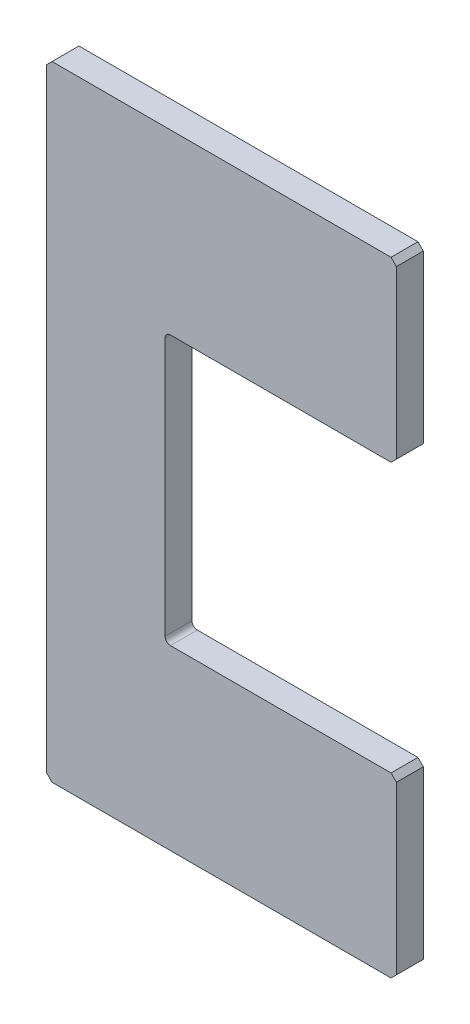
from build123d import *

# Parameters (mm, degrees)
EXTRUDE_1_DEPTH = 0.5
FILLET_1_R      = 0.1
CHAMFER_1_SIZE  = 0.1


with BuildPart() as part:
    # Sketch 1 → Extrude 1 (new body)
    with BuildSketch(Plane.XY):
        Polygon((0, 0), (6.5, 0), (6.5, -3.3), (2.2, -3.3), (2.2, -8.3), (6.5, -8.3), (6.5, -11.6), (0, -11.6), align=None)
    extrude(amount=EXTRUDE_1_DEPTH)

    # Fillet 1
    fillet_1_edges = [part.edges().sort_by_distance(p)[0] for p in [
        (2.2, -3.3, 0.25),
        (2.2, -8.3, 0.25),
    ]]
    fillet(fillet_1_edges, radius=FILLET_1_R)

    # Chamfer 1
    chamfer_1_edges = [part.edges().sort_by_distance(p)[0] for p in [
        (0, 0, 0.25),
        (6.5, 0, 0.25),
        (6.5, -3.3, 0.25),
        (6.5, -8.3, 0.25),
        (6.5, -11.6, 0.25),
        (0, -11.6, 0.25),
    ]]
    chamfer(chamfer_1_edges, length=CHAMFER_1_SIZE)


solid = part.part
